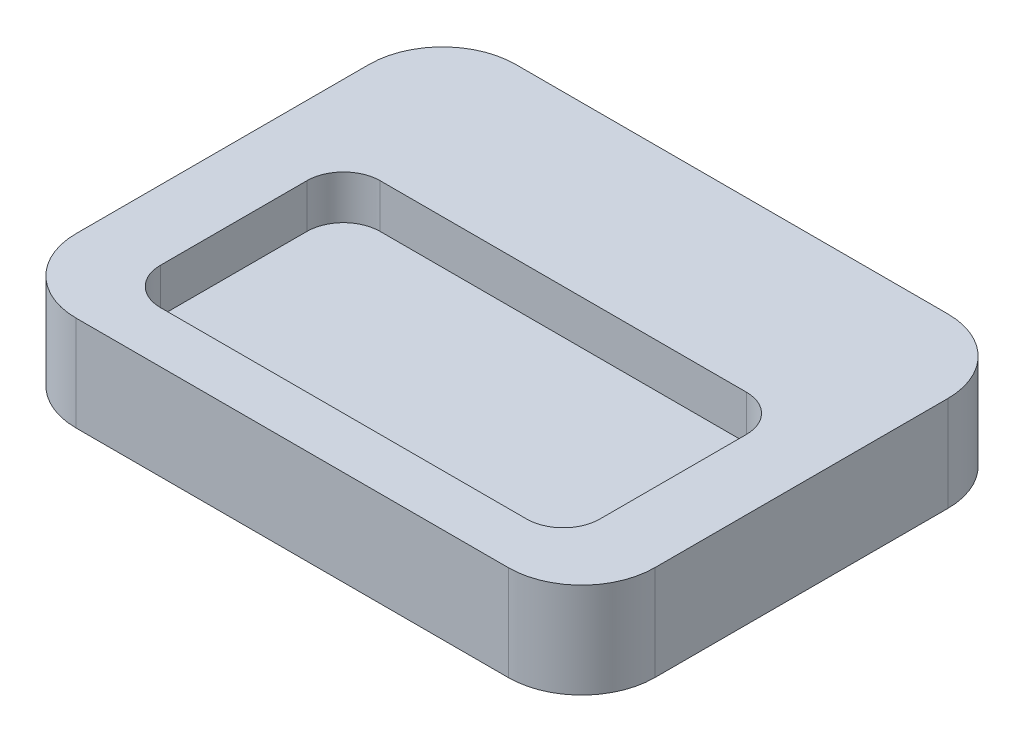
from build123d import *

# Parameters (mm, degrees)
EXTRUDE_1_DEPTH     = 26
CUT_EXTRUDE_1_DEPTH = 15
CUT_EXTRUDE_2_DEPTH = 13
CUT_EXTRUDE_5_DEPTH = 19
SKETCH_3_W          = 90.351665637
SKETCH_3_H          = 66.199818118
CUT_EXTRUDE_6_DEPTH = 13
CUT_EXTRUDE_7_DEPTH = 2
CUT_EXTRUDE_8_DEPTH = 2


with BuildPart() as part:
    # Sketch 1 → Extrude 1 (new body)
    with BuildSketch(Plane(origin=(0, 0, 0), x_dir=(1, 0, 0), z_dir=(0, 1, 0))):
        with BuildLine():
            ThreePointArc((-36.372007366, 5.05801105), (-33.443075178, 12.129078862), (-26.372007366, 15.05801105))
            Line((-26.372007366, 15.05801105), (32.627992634, 15.05801105))
            ThreePointArc((32.627992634, 15.05801105), (39.699060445, 12.129078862), (42.627992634, 5.05801105))
            Line((42.627992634, 5.05801105), (42.627992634, -34.94198895))
            ThreePointArc((42.627992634, -34.94198895), (39.699060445, -42.013056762), (32.627992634, -44.94198895))
            Line((32.627992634, -44.94198895), (-26.372007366, -44.94198895))
            ThreePointArc((-26.372007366, -44.94198895), (-33.443075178, -42.013056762), (-36.372007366, -34.94198895))
            Line((-36.372007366, -34.94198895), (-36.372007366, 5.05801105))
        make_face()
    extrude(amount=EXTRUDE_1_DEPTH)

    # Sketch 2 → Cut-Extrude 1 (cut)
    with BuildSketch(Plane(origin=(0, 26, 0), x_dir=(1, 0, 0), z_dir=(0, 1, 0))):
        with BuildLine():
            Line((28.127992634, -37.94198895), (-21.872007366, -37.94198895))
            ThreePointArc((-21.872007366, -37.94198895), (-25.407541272, -36.477522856), (-26.872007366, -32.94198895))
            Line((-26.872007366, -32.94198895), (-26.872007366, -12.94198895))
            ThreePointArc((-26.872007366, -12.94198895), (-25.407541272, -9.406455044), (-21.872007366, -7.94198895))
            Line((-21.872007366, -7.94198895), (28.127992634, -7.94198895))
            ThreePointArc((28.127992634, -7.94198895), (31.663526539, -9.406455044), (33.127992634, -12.94198895))
            Line((33.127992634, -12.94198895), (33.127992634, -32.94198895))
            ThreePointArc((33.127992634, -32.94198895), (31.663526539, -36.477522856), (28.127992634, -37.94198895))
        make_face()
    extrude(amount=-CUT_EXTRUDE_1_DEPTH, mode=Mode.SUBTRACT)

    # Sketch 2_5 → Cut-Extrude 2 (cut)
    with BuildSketch(Plane(origin=(0, 26, 0), x_dir=(1, 0, 0), z_dir=(0, 1, 0))):
        with BuildLine():
            Line((-19.372007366, -7.94198895), (25.627992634, -7.94198895))
            Line((25.627992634, -7.94198895), (25.627992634, 2.05801105))
            ThreePointArc((25.627992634, 2.05801105), (24.163526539, 5.593544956), (20.627992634, 7.05801105))
            Line((20.627992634, 7.05801105), (-14.372007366, 7.05801105))
            ThreePointArc((-14.372007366, 7.05801105), (-17.907541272, 5.593544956), (-19.372007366, 2.05801105))
            Line((-19.372007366, 2.05801105), (-19.372007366, -7.94198895))
        make_face()
    extrude(amount=-CUT_EXTRUDE_2_DEPTH, mode=Mode.SUBTRACT)

    # Sketch 2_10 → Cut-Extrude 5 (cut)
    with BuildSketch(Plane(origin=(0, 26, 0), x_dir=(1, 0, 0), z_dir=(0, 1, 0))):
        with BuildLine():
            Line((28.127992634, -37.94198895), (-21.872007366, -37.94198895))
            ThreePointArc((-21.872007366, -37.94198895), (-25.407541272, -36.477522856), (-26.872007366, -32.94198895))
            Line((-26.872007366, -32.94198895), (-26.872007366, -12.94198895))
            ThreePointArc((-26.872007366, -12.94198895), (-25.407541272, -9.406455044), (-21.872007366, -7.94198895))
            Line((-21.872007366, -7.94198895), (28.127992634, -7.94198895))
            ThreePointArc((28.127992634, -7.94198895), (31.663526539, -9.406455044), (33.127992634, -12.94198895))
            Line((33.127992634, -12.94198895), (33.127992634, -32.94198895))
            ThreePointArc((33.127992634, -32.94198895), (31.663526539, -36.477522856), (28.127992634, -37.94198895))
        make_face()
    extrude(amount=-CUT_EXTRUDE_5_DEPTH, mode=Mode.SUBTRACT)

    # Sketch 3 → Cut-Extrude 6 (cut)
    with BuildSketch(Plane(origin=(0, 26, 0), x_dir=(1, 0, 0), z_dir=(0, 1, 0))):
        with Locations((8.314700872, -15.456700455)):
            Rectangle(SKETCH_3_W, SKETCH_3_H)
    extrude(amount=-CUT_EXTRUDE_6_DEPTH, mode=Mode.SUBTRACT)

    # Sketch 4 → Cut-Extrude 7 (cut)
    with BuildSketch(Plane.XZ):
        with BuildLine():
            Line((-21.872007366, -8.30801105), (28.127992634, -8.30801105))
            ThreePointArc((28.127992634, -8.30801105), (29.542206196, -7.722224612), (30.127992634, -6.30801105))
            Line((30.127992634, -6.30801105), (30.127992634, 16.19198895))
            ThreePointArc((30.127992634, 16.19198895), (29.542206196, 17.606202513), (28.127992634, 18.19198895))
            Line((28.127992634, 18.19198895), (-21.872007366, 18.19198895))
            ThreePointArc((-21.872007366, 18.19198895), (-23.286220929, 17.606202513), (-23.872007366, 16.19198895))
            Line((-23.872007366, 16.19198895), (-23.872007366, -6.30801105))
            ThreePointArc((-23.872007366, -6.30801105), (-23.286220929, -7.722224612), (-21.872007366, -8.30801105))
        make_face()
    extrude(amount=-CUT_EXTRUDE_7_DEPTH, mode=Mode.SUBTRACT)

    # Sketch 5 → Cut-Extrude 8 (cut)
    with BuildSketch(Plane.XZ):
        with BuildLine():
            Line((0.127992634, 29.94198895), (6.127992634, 29.94198895))
            ThreePointArc((6.127992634, 29.94198895), (7.542206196, 30.527775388), (8.127992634, 31.94198895))
            Line((8.127992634, 31.94198895), (8.127992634, 37.94198895))
            ThreePointArc((8.127992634, 37.94198895), (7.542206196, 39.356202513), (6.127992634, 39.94198895))
            Line((6.127992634, 39.94198895), (0.127992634, 39.94198895))
            ThreePointArc((0.127992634, 39.94198895), (-1.286220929, 39.356202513), (-1.872007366, 37.94198895))
            Line((-1.872007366, 37.94198895), (-1.872007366, 31.94198895))
            ThreePointArc((-1.872007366, 31.94198895), (-1.286220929, 30.527775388), (0.127992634, 29.94198895))
        make_face()
    extrude(amount=-CUT_EXTRUDE_8_DEPTH, mode=Mode.SUBTRACT)


solid = part.part
